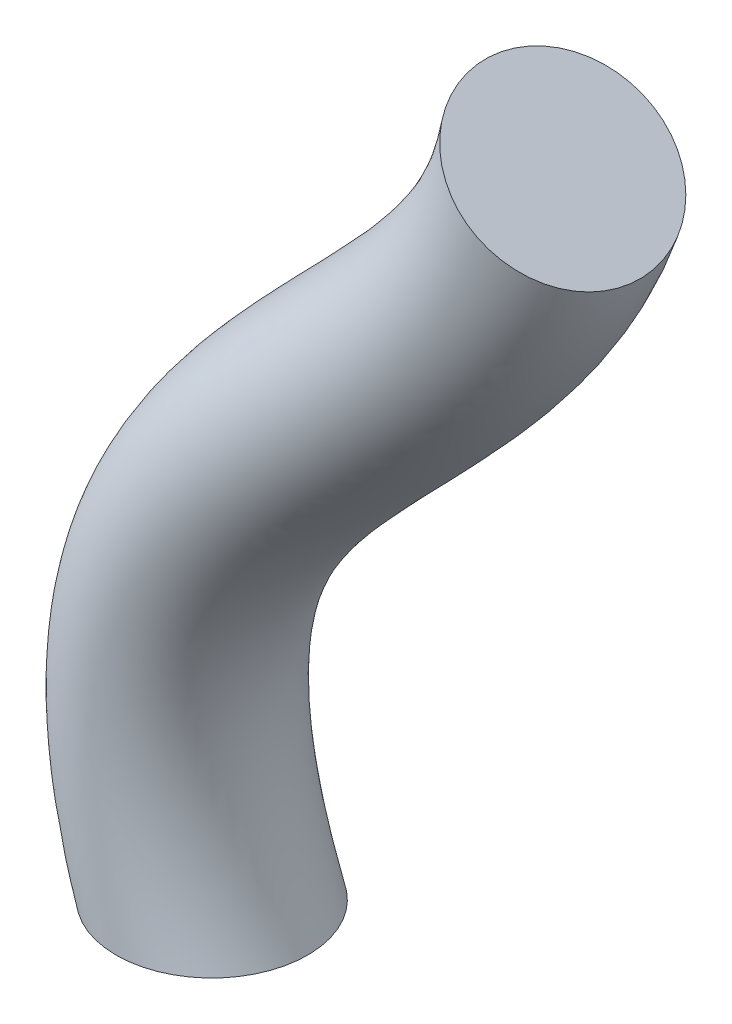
from build123d import *

# Parameters (mm, degrees)
SKETCH3_R = 8.760552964


with BuildPart() as part:
    # Sweep1: sweep along a path in Sketch1
    with BuildLine() as sweep1_path:  # in the path sketch's own coordinates; laid on its plane below (add() does not lay a ready-made edge on the line's plane)
        add(Edge.make_bspline(
            [(0, 0), (-14.188461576, 38.325227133), (24.352567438, 46.802305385), (32.081989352, 73.926406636)],
            knots=[0, 0, 0, 0, 1, 1, 1, 1], degree=3))
    # Sketch3 → Sweep1 (sweep)
    with BuildSketch(Plane(origin=(0, 0, 0), x_dir=(1, 0, 0), z_dir=(0, 1, 0))):
        Circle(SKETCH3_R)
    sweep(path=Plane.XY * sweep1_path.line)


solid = part.part
